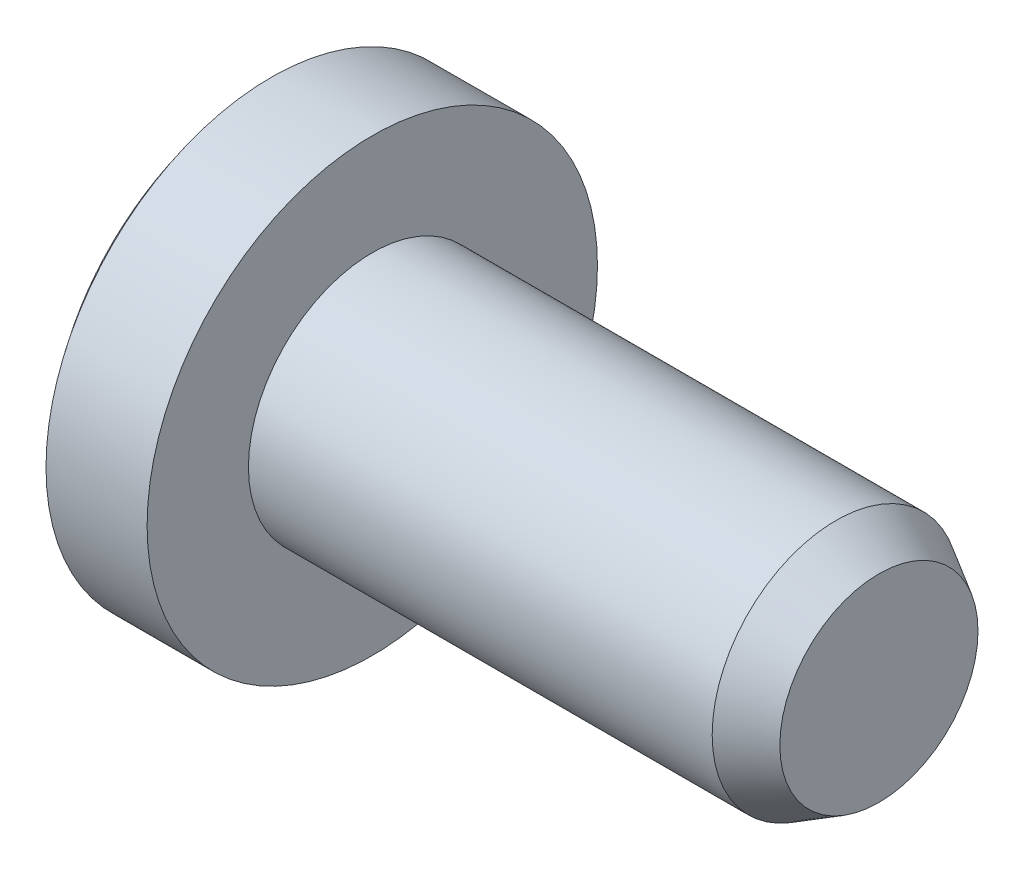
from build123d import *

# Parameters (mm, degrees)
CHAMFER1_SIZE      = 0.22
CHAMFER1_SIZE2     = 0.381051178
CUT_EXTRUDE1_DEPTH = 0.8
CUT_EXTRUDE1_TAPER = 6


with BuildPart() as part:
    # Sketch1 → Revolve1 (revolve)
    with BuildSketch(Plane.XY, mode=Mode.PRIVATE) as revolve1_sk:
        with BuildLine():
            Line((0, 2), (-0.897999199, 2))
            ThreePointArc((-0.897999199, 2), (-1.419403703, 1.059811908), (-1.6, 0))
            Line((-1.6, 0), (4.5, 0))
            Line((4.5, 0), (4.5, 1.1))
            Line((4.5, 1.1), (0, 1.1))
            Line((0, 1.1), (0, 2))
        make_face()
    revolve(revolve1_sk.sketch.rotate(Axis((0, 0, 0), (1, 0, 0)), 90), axis=Axis((0, 0, 0), (1, 0, 0)))

    # Chamfer1
    chamfer1_edges = [part.edges().sort_by_distance(p)[0] for p in [
        (4.5, 0, -1.1),
    ]]
    chamfer1_side = [part.faces().sort_by_distance(p)[0] for p in [
        (4.5, 0, 0),
    ]]
    chamfer(chamfer1_edges, length=CHAMFER1_SIZE, length2=CHAMFER1_SIZE2, reference=chamfer1_side[0])

    # Sketch3 → Cut-Extrude1 (cut)
    with BuildSketch(Plane(origin=(-1.6, 0, 0), x_dir=(0, 0, -1), z_dir=(1, 0, 0))):
        Polygon((-0.2375, 0.95), (-0.1425, 0.57), (-0.29897586, 0.29897586), (-0.57, 0.1425), (-0.95, 0.2375), (-0.95, -0.2375), (-0.57, -0.1425), (-0.29897586, -0.29897586), (-0.1425, -0.57), (-0.2375, -0.95), (0.2375, -0.95), (0.1425, -0.57), (0.29897586, -0.29897586), (0.57, -0.1425), (0.95, -0.2375), (0.95, 0.2375), (0.57, 0.1425), (0.29897586, 0.29897586), (0.1425, 0.57), (0.2375, 0.95), align=None)
    extrude(amount=CUT_EXTRUDE1_DEPTH, taper=CUT_EXTRUDE1_TAPER, mode=Mode.SUBTRACT)


solid = part.part
